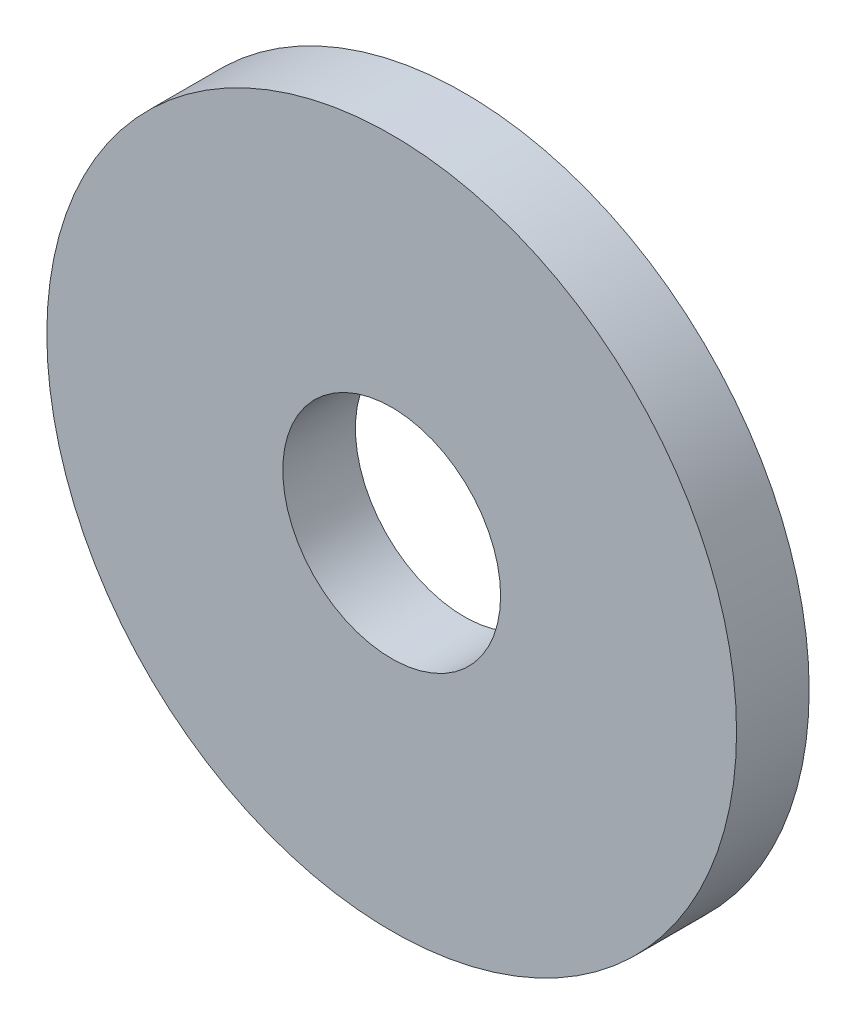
ISO-10303-21;
HEADER;
FILE_DESCRIPTION(('STEP AP214'),'2;1');
FILE_NAME('part.step','',(''),(''),'','','');
FILE_SCHEMA(('AUTOMOTIVE_DESIGN { 1 0 10303 214 1 1 1 1 }'));
ENDSEC;
DATA;
#1=APPLICATION_CONTEXT('core data for automotive mechanical design processes');
#2=APPLICATION_PROTOCOL_DEFINITION('international standard','automotive_design',2000,#1);
#3=PRODUCT_CONTEXT('',#1,'mechanical');
#4=PRODUCT('Part','Part','',(#3));
#5=PRODUCT_RELATED_PRODUCT_CATEGORY('part','',(#4));
#6=PRODUCT_DEFINITION_FORMATION('','',#4);
#7=PRODUCT_DEFINITION_CONTEXT('part definition',#1,'design');
#8=PRODUCT_DEFINITION('design','',#6,#7);
#9=PRODUCT_DEFINITION_SHAPE('','',#8);
#10=(LENGTH_UNIT() NAMED_UNIT(*) SI_UNIT(.MILLI.,.METRE.));
#11=(NAMED_UNIT(*) PLANE_ANGLE_UNIT() SI_UNIT($,.RADIAN.));
#12=(NAMED_UNIT(*) SI_UNIT($,.STERADIAN.) SOLID_ANGLE_UNIT());
#13=UNCERTAINTY_MEASURE_WITH_UNIT(LENGTH_MEASURE(1.E-05),#10,'distance_accuracy_value','');
#14=(GEOMETRIC_REPRESENTATION_CONTEXT(3) GLOBAL_UNCERTAINTY_ASSIGNED_CONTEXT((#13)) GLOBAL_UNIT_ASSIGNED_CONTEXT((#10,
#11,#12)) REPRESENTATION_CONTEXT('',''));
#15=CARTESIAN_POINT('',(0.,0.,0.));
#16=DIRECTION('',(0.,0.,1.));
#17=DIRECTION('',(1.,0.,0.));
#18=AXIS2_PLACEMENT_3D('',#15,#16,#17);
#19=CARTESIAN_POINT('',(0.,0.,1.));
#20=DIRECTION('',(0.,0.,1.));
#21=DIRECTION('',(1.,0.,0.));
#22=AXIS2_PLACEMENT_3D('',#19,#20,#21);
#23=PLANE('',#22);
#24=CARTESIAN_POINT('',(0.,0.,1.));
#25=DIRECTION('',(0.,0.,1.));
#26=DIRECTION('',(1.,0.,0.));
#27=AXIS2_PLACEMENT_3D('',#24,#25,#26);
#28=CIRCLE('',#27,4.75);
#29=CARTESIAN_POINT('',(4.75,0.,1.));
#30=VERTEX_POINT('',#29);
#31=EDGE_CURVE('E10',#30,#30,#28,.T.);
#32=ORIENTED_EDGE('',*,*,#31,.T.);
#33=EDGE_LOOP('',(#32));
#34=FACE_BOUND('',#33,.T.);
#35=CARTESIAN_POINT('',(0.,0.,1.));
#36=DIRECTION('',(0.,0.,1.));
#37=DIRECTION('',(1.,0.,0.));
#38=AXIS2_PLACEMENT_3D('',#35,#36,#37);
#39=CIRCLE('',#38,1.5);
#40=CARTESIAN_POINT('',(1.5,0.,1.));
#41=VERTEX_POINT('',#40);
#42=EDGE_CURVE('E44',#41,#41,#39,.T.);
#43=ORIENTED_EDGE('',*,*,#42,.F.);
#44=EDGE_LOOP('',(#43));
#45=FACE_BOUND('',#44,.T.);
#46=ADVANCED_FACE('F33',(#34,#45),#23,.T.);
#47=CARTESIAN_POINT('',(0.,0.,0.));
#48=DIRECTION('',(0.,0.,1.));
#49=DIRECTION('',(1.,0.,0.));
#50=AXIS2_PLACEMENT_3D('',#47,#48,#49);
#51=PLANE('',#50);
#52=CARTESIAN_POINT('',(0.,0.,0.));
#53=DIRECTION('',(0.,0.,1.));
#54=DIRECTION('',(1.,0.,0.));
#55=AXIS2_PLACEMENT_3D('',#52,#53,#54);
#56=CIRCLE('',#55,4.75);
#57=CARTESIAN_POINT('',(4.75,0.,0.));
#58=VERTEX_POINT('',#57);
#59=EDGE_CURVE('E40',#58,#58,#56,.T.);
#60=ORIENTED_EDGE('',*,*,#59,.F.);
#61=EDGE_LOOP('',(#60));
#62=FACE_BOUND('',#61,.T.);
#63=CARTESIAN_POINT('',(0.,0.,0.));
#64=DIRECTION('',(0.,0.,1.));
#65=DIRECTION('',(1.,0.,0.));
#66=AXIS2_PLACEMENT_3D('',#63,#64,#65);
#67=CIRCLE('',#66,1.5);
#68=CARTESIAN_POINT('',(1.5,0.,0.));
#69=VERTEX_POINT('',#68);
#70=EDGE_CURVE('E48',#69,#69,#67,.T.);
#71=ORIENTED_EDGE('',*,*,#70,.T.);
#72=EDGE_LOOP('',(#71));
#73=FACE_BOUND('',#72,.T.);
#74=ADVANCED_FACE('F54',(#62,#73),#51,.F.);
#75=CARTESIAN_POINT('',(0.,0.,1.));
#76=DIRECTION('',(0.,0.,-1.));
#77=DIRECTION('',(-1.,0.,0.));
#78=AXIS2_PLACEMENT_3D('',#75,#76,#77);
#79=CYLINDRICAL_SURFACE('',#78,4.75);
#80=ORIENTED_EDGE('',*,*,#31,.F.);
#81=EDGE_LOOP('',(#80));
#82=FACE_BOUND('',#81,.T.);
#83=ORIENTED_EDGE('',*,*,#59,.T.);
#84=EDGE_LOOP('',(#83));
#85=FACE_BOUND('',#84,.T.);
#86=ADVANCED_FACE('F35',(#82,#85),#79,.T.);
#87=CARTESIAN_POINT('',(0.,0.,1.));
#88=DIRECTION('',(0.,0.,-1.));
#89=DIRECTION('',(-1.,0.,0.));
#90=AXIS2_PLACEMENT_3D('',#87,#88,#89);
#91=CYLINDRICAL_SURFACE('',#90,1.5);
#92=ORIENTED_EDGE('',*,*,#42,.T.);
#93=EDGE_LOOP('',(#92));
#94=FACE_BOUND('',#93,.T.);
#95=ORIENTED_EDGE('',*,*,#70,.F.);
#96=EDGE_LOOP('',(#95));
#97=FACE_BOUND('',#96,.T.);
#98=ADVANCED_FACE('F56',(#94,#97),#91,.F.);
#99=CLOSED_SHELL('',(#46,#74,#86,#98));
#100=MANIFOLD_SOLID_BREP('B2',#99);
#101=ADVANCED_BREP_SHAPE_REPRESENTATION('',(#18,#100),#14);
#102=SHAPE_DEFINITION_REPRESENTATION(#9,#101);
ENDSEC;
END-ISO-10303-21;
